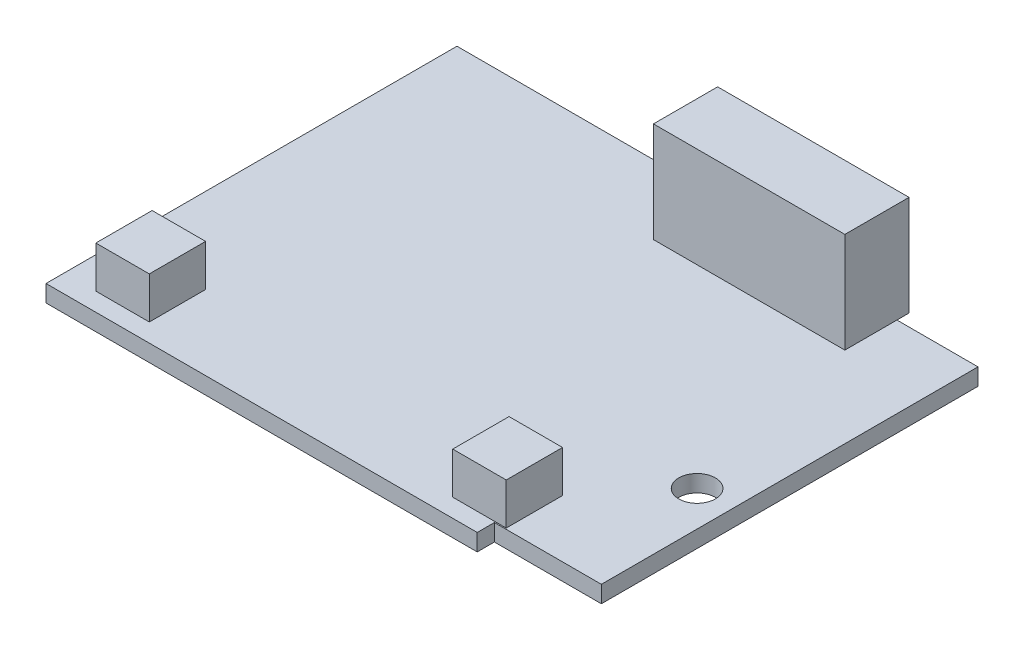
from build123d import *

# Parameters (mm, degrees)
SKETCH1_R         = 1.651
EXTRUDE1_DEPTH    = 1.524
SKETCH2_W         = 17.272
SKETCH2_H         = 5.7912
HEADER_CONN_DEPTH = 9.0424
SKETCH3_W         = 4.826
SKETCH3_H         = 5.08
TRIMPOTS_DEPTH    = 3.7592
SKETCH4_W         = 16.764
SKETCH4_H         = 2.413
EXTRUDE4_DEPTH    = 6.477


with BuildPart() as part:
    # Sketch1 → Extrude1 (new body)
    with BuildSketch(Plane(origin=(0, 0, 0), x_dir=(1, 0, 0), z_dir=(0, 1, 0))):
        Polygon((-9.652, 18.542), (-9.652, 16.9926), (0, 16.9926), (0, -16.9926), (-9.652, -16.9926), (-9.652, -18.542), (-48.5648, -18.542), (-48.5648, 18.542), align=None)
        with Locations(Location((-3.175, -5.1816, 0), (0, 0, 90))):
            Circle(SKETCH1_R, mode=Mode.SUBTRACT)
    extrude(amount=EXTRUDE1_DEPTH)

    # Sketch2 → Header_Conn (add)
    with BuildSketch(Plane(origin=(0, 1.524, 0), x_dir=(1, 0, 0), z_dir=(0, 1, 0))):
        with Locations((-15.9512, 15.1892)):
            Rectangle(SKETCH2_W, SKETCH2_H)
    extrude(amount=HEADER_CONN_DEPTH)

    # Sketch3 → TrimPots (add)
    with BuildSketch(Plane(origin=(0, 1.524, 0), x_dir=(1, 0, 0), z_dir=(0, 1, 0))):
        with Locations((-43.307, -14.351)):
            Rectangle(SKETCH3_W, SKETCH3_H)
        with Locations((-11.0998, -14.351)):
            Rectangle(SKETCH3_W, SKETCH3_H)
    extrude(amount=TRIMPOTS_DEPTH)

    # Sketch4 → Extrude4 (add, along a direction that is not the sketch's normal)
    with BuildSketch(Plane.XZ):
        with Locations((-38.7858, -5.0927)):
            Rectangle(SKETCH4_W, SKETCH4_H)
        with Locations((-38.7858, 4.8895)):
            Rectangle(SKETCH4_W, SKETCH4_H)
    extrude(amount=EXTRUDE4_DEPTH, dir=(0.020942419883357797, -0.9997806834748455, 0))


solid = part.part
